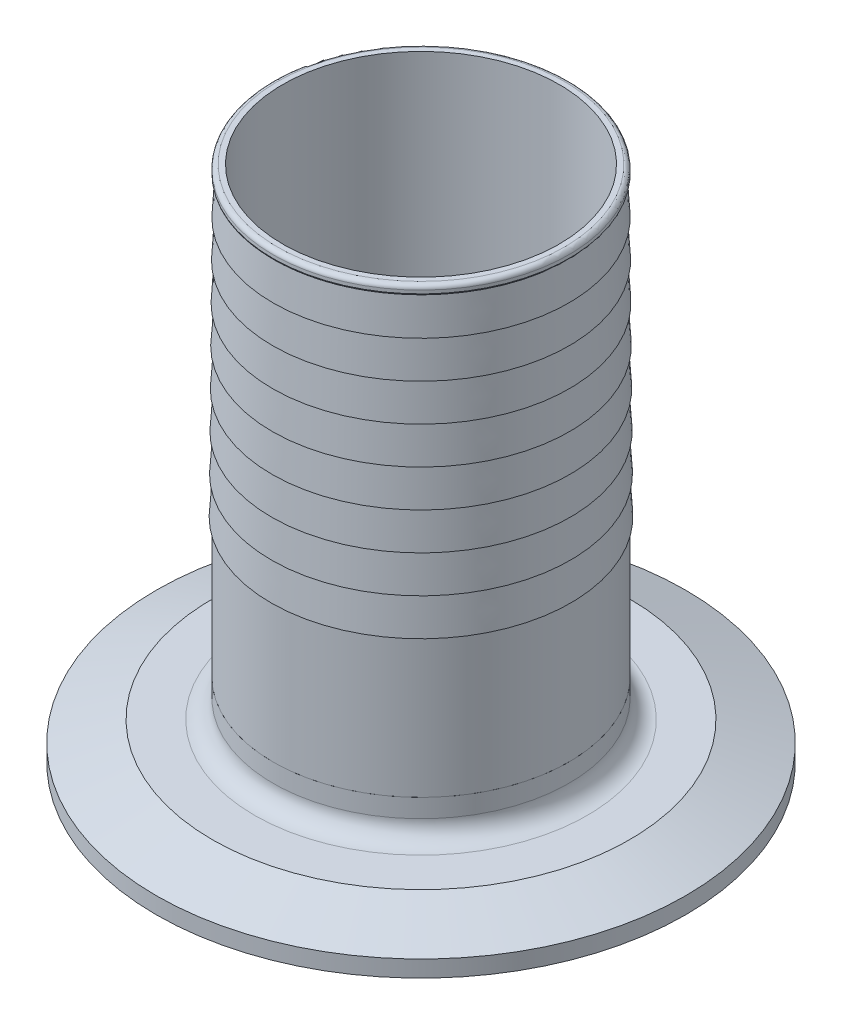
ISO-10303-21;
HEADER;
FILE_DESCRIPTION(('STEP AP214'),'2;1');
FILE_NAME('part.step','',(''),(''),'','','');
FILE_SCHEMA(('AUTOMOTIVE_DESIGN { 1 0 10303 214 1 1 1 1 }'));
ENDSEC;
DATA;
#1=APPLICATION_CONTEXT('core data for automotive mechanical design processes');
#2=APPLICATION_PROTOCOL_DEFINITION('international standard','automotive_design',2000,#1);
#3=PRODUCT_CONTEXT('',#1,'mechanical');
#4=PRODUCT('Part','Part','',(#3));
#5=PRODUCT_RELATED_PRODUCT_CATEGORY('part','',(#4));
#6=PRODUCT_DEFINITION_FORMATION('','',#4);
#7=PRODUCT_DEFINITION_CONTEXT('part definition',#1,'design');
#8=PRODUCT_DEFINITION('design','',#6,#7);
#9=PRODUCT_DEFINITION_SHAPE('','',#8);
#10=(LENGTH_UNIT() NAMED_UNIT(*) SI_UNIT(.MILLI.,.METRE.));
#11=(NAMED_UNIT(*) PLANE_ANGLE_UNIT() SI_UNIT($,.RADIAN.));
#12=(NAMED_UNIT(*) SI_UNIT($,.STERADIAN.) SOLID_ANGLE_UNIT());
#13=UNCERTAINTY_MEASURE_WITH_UNIT(LENGTH_MEASURE(1.E-05),#10,'distance_accuracy_value','');
#14=(GEOMETRIC_REPRESENTATION_CONTEXT(3) GLOBAL_UNCERTAINTY_ASSIGNED_CONTEXT((#13)) GLOBAL_UNIT_ASSIGNED_CONTEXT((#10,
#11,#12)) REPRESENTATION_CONTEXT('',''));
#15=CARTESIAN_POINT('',(0.,0.,0.));
#16=DIRECTION('',(0.,0.,1.));
#17=DIRECTION('',(1.,0.,0.));
#18=AXIS2_PLACEMENT_3D('',#15,#16,#17);
#19=CARTESIAN_POINT('',(69.3578354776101,55.2063556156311,71.2690609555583));
#20=DIRECTION('',(0.,-1.,0.));
#21=DIRECTION('',(0.140194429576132,0.,-0.990123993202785));
#22=AXIS2_PLACEMENT_3D('',#19,#20,#21);
#23=PLANE('',#22);
#24=CARTESIAN_POINT('',(44.2086860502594,55.2063556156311,67.7081224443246));
#25=DIRECTION('',(0.,-1.,0.));
#26=DIRECTION('',(0.140194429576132,0.,-0.990123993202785));
#27=AXIS2_PLACEMENT_3D('',#24,#25,#26);
#28=CIRCLE('',#27,23.749);
#29=CARTESIAN_POINT('',(47.5381635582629,55.2063556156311,44.1936677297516));
#30=VERTEX_POINT('',#29);
#31=EDGE_CURVE('P0_E88',#30,#30,#28,.T.);
#32=ORIENTED_EDGE('',*,*,#31,.F.);
#33=EDGE_LOOP('',(#32));
#34=FACE_BOUND('',#33,.T.);
#35=CARTESIAN_POINT('',(44.2086860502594,55.2063556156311,67.7081224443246));
#36=DIRECTION('',(0.,-1.,0.));
#37=DIRECTION('',(0.140194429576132,0.,-0.990123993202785));
#38=AXIS2_PLACEMENT_3D('',#35,#36,#37);
#39=CIRCLE('',#38,25.4);
#40=CARTESIAN_POINT('',(47.7696245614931,55.2063556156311,42.5589730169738));
#41=VERTEX_POINT('',#40);
#42=EDGE_CURVE('P0_E9',#41,#41,#39,.T.);
#43=ORIENTED_EDGE('',*,*,#42,.T.);
#44=EDGE_LOOP('',(#43));
#45=FACE_BOUND('',#44,.T.);
#46=ADVANCED_FACE('P0_F14',(#34,#45),#23,.T.);
#47=CARTESIAN_POINT('',(44.2086860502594,55.2063556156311,67.7081224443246));
#48=DIRECTION('',(0.,-1.,0.));
#49=DIRECTION('',(0.140194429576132,0.,-0.990123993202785));
#50=AXIS2_PLACEMENT_3D('',#47,#48,#49);
#51=CYLINDRICAL_SURFACE('',#50,25.4);
#52=CARTESIAN_POINT('',(44.2086860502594,79.0300392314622,67.7081224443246));
#53=DIRECTION('',(0.,-1.,0.));
#54=DIRECTION('',(0.140194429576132,0.,-0.990123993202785));
#55=AXIS2_PLACEMENT_3D('',#52,#53,#54);
#56=CIRCLE('',#55,25.4);
#57=CARTESIAN_POINT('',(47.7696245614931,79.0300392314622,42.5589730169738));
#58=VERTEX_POINT('',#57);
#59=EDGE_CURVE('P0_E20',#58,#58,#56,.T.);
#60=ORIENTED_EDGE('',*,*,#59,.T.);
#61=EDGE_LOOP('',(#60));
#62=FACE_BOUND('',#61,.T.);
#63=ORIENTED_EDGE('',*,*,#42,.F.);
#64=EDGE_LOOP('',(#63));
#65=FACE_BOUND('',#64,.T.);
#66=ADVANCED_FACE('P0_F104',(#62,#65),#51,.T.);
#67=CARTESIAN_POINT('',(69.687918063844,79.0300365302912,71.3157982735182));
#68=DIRECTION('',(0.,-1.,0.));
#69=DIRECTION('',(0.140194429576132,0.,-0.990123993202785));
#70=AXIS2_PLACEMENT_3D('',#67,#68,#69);
#71=PLANE('',#70);
#72=CARTESIAN_POINT('',(44.2086860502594,79.0300338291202,67.7081224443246));
#73=DIRECTION('',(0.,-1.,0.));
#74=DIRECTION('',(0.140194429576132,0.,-0.990123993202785));
#75=AXIS2_PLACEMENT_3D('',#72,#73,#74);
#76=CIRCLE('',#75,25.733375);
#77=CARTESIAN_POINT('',(47.8163618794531,79.0300338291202,42.2288904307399));
#78=VERTEX_POINT('',#77);
#79=EDGE_CURVE('P0_E24',#78,#78,#76,.T.);
#80=ORIENTED_EDGE('',*,*,#79,.T.);
#81=EDGE_LOOP('',(#80));
#82=FACE_BOUND('',#81,.T.);
#83=ORIENTED_EDGE('',*,*,#59,.F.);
#84=EDGE_LOOP('',(#83));
#85=FACE_BOUND('',#84,.T.);
#86=ADVANCED_FACE('P0_F109',(#82,#85),#71,.T.);
#87=CARTESIAN_POINT('',(44.2086860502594,79.0300338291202,67.7081224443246));
#88=DIRECTION('',(0.,-1.,0.));
#89=DIRECTION('',(0.140194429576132,0.,-0.990123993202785));
#90=AXIS2_PLACEMENT_3D('',#87,#88,#89);
#91=CONICAL_SURFACE('',#90,25.733375,0.0599260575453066);
#92=CARTESIAN_POINT('',(44.2086860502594,85.3802566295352,67.7081224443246));
#93=DIRECTION('',(0.,-1.,0.));
#94=DIRECTION('',(0.140194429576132,0.,-0.990123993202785));
#95=AXIS2_PLACEMENT_3D('',#92,#93,#94);
#96=CIRCLE('',#95,25.352375);
#97=CARTESIAN_POINT('',(47.7629478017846,85.3802566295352,42.6061276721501));
#98=VERTEX_POINT('',#97);
#99=EDGE_CURVE('P0_E28',#98,#98,#96,.T.);
#100=ORIENTED_EDGE('',*,*,#99,.T.);
#101=EDGE_LOOP('',(#100));
#102=FACE_BOUND('',#101,.T.);
#103=ORIENTED_EDGE('',*,*,#79,.F.);
#104=EDGE_LOOP('',(#103));
#105=FACE_BOUND('',#104,.T.);
#106=ADVANCED_FACE('P0_F113',(#102,#105),#91,.T.);
#107=CARTESIAN_POINT('',(69.6407634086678,85.3802539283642,71.3091215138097));
#108=DIRECTION('',(0.,-1.,0.));
#109=DIRECTION('',(0.140194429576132,0.,-0.990123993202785));
#110=AXIS2_PLACEMENT_3D('',#107,#108,#109);
#111=PLANE('',#110);
#112=CARTESIAN_POINT('',(44.2086860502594,85.3802512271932,67.7081224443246));
#113=DIRECTION('',(0.,-1.,0.));
#114=DIRECTION('',(0.140194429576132,0.,-0.990123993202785));
#115=AXIS2_PLACEMENT_3D('',#112,#113,#114);
#116=CIRCLE('',#115,25.68575);
#117=CARTESIAN_POINT('',(47.8096851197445,85.3802512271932,42.2760450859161));
#118=VERTEX_POINT('',#117);
#119=EDGE_CURVE('P0_E33',#118,#118,#116,.T.);
#120=ORIENTED_EDGE('',*,*,#119,.T.);
#121=EDGE_LOOP('',(#120));
#122=FACE_BOUND('',#121,.T.);
#123=ORIENTED_EDGE('',*,*,#99,.F.);
#124=EDGE_LOOP('',(#123));
#125=FACE_BOUND('',#124,.T.);
#126=ADVANCED_FACE('P0_F120',(#122,#125),#111,.T.);
#127=CARTESIAN_POINT('',(44.2086860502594,85.3802512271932,67.7081224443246));
#128=DIRECTION('',(0.,-1.,0.));
#129=DIRECTION('',(0.140194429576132,0.,-0.990123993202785));
#130=AXIS2_PLACEMENT_3D('',#127,#128,#129);
#131=CONICAL_SURFACE('',#130,25.68575,0.0599260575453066);
#132=CARTESIAN_POINT('',(44.2086860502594,91.7304740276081,67.7081224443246));
#133=DIRECTION('',(0.,-1.,0.));
#134=DIRECTION('',(0.140194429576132,0.,-0.990123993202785));
#135=AXIS2_PLACEMENT_3D('',#132,#133,#134);
#136=CIRCLE('',#135,25.30475);
#137=CARTESIAN_POINT('',(47.756271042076,91.7304740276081,42.6532823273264));
#138=VERTEX_POINT('',#137);
#139=EDGE_CURVE('P0_E36',#138,#138,#136,.T.);
#140=ORIENTED_EDGE('',*,*,#139,.T.);
#141=EDGE_LOOP('',(#140));
#142=FACE_BOUND('',#141,.T.);
#143=ORIENTED_EDGE('',*,*,#119,.F.);
#144=EDGE_LOOP('',(#143));
#145=FACE_BOUND('',#144,.T.);
#146=ADVANCED_FACE('P0_F124',(#142,#145),#131,.T.);
#147=CARTESIAN_POINT('',(69.5936087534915,91.7304713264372,71.3024447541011));
#148=DIRECTION('',(0.,-1.,0.));
#149=DIRECTION('',(0.140194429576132,0.,-0.990123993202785));
#150=AXIS2_PLACEMENT_3D('',#147,#148,#149);
#151=PLANE('',#150);
#152=CARTESIAN_POINT('',(44.2086860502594,91.7304686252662,67.7081224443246));
#153=DIRECTION('',(0.,-1.,0.));
#154=DIRECTION('',(0.140194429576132,0.,-0.990123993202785));
#155=AXIS2_PLACEMENT_3D('',#152,#153,#154);
#156=CIRCLE('',#155,25.638125);
#157=CARTESIAN_POINT('',(47.8030083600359,91.7304686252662,42.3231997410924));
#158=VERTEX_POINT('',#157);
#159=EDGE_CURVE('P0_E39',#158,#158,#156,.T.);
#160=ORIENTED_EDGE('',*,*,#159,.T.);
#161=EDGE_LOOP('',(#160));
#162=FACE_BOUND('',#161,.T.);
#163=ORIENTED_EDGE('',*,*,#139,.F.);
#164=EDGE_LOOP('',(#163));
#165=FACE_BOUND('',#164,.T.);
#166=ADVANCED_FACE('P0_F128',(#162,#165),#151,.T.);
#167=CARTESIAN_POINT('',(44.2086860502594,91.7304686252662,67.7081224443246));
#168=DIRECTION('',(0.,-1.,0.));
#169=DIRECTION('',(0.140194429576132,0.,-0.990123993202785));
#170=AXIS2_PLACEMENT_3D('',#167,#168,#169);
#171=CONICAL_SURFACE('',#170,25.638125,0.0599260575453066);
#172=CARTESIAN_POINT('',(44.2086860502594,98.0806914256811,67.7081224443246));
#173=DIRECTION('',(0.,-1.,0.));
#174=DIRECTION('',(0.140194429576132,0.,-0.990123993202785));
#175=AXIS2_PLACEMENT_3D('',#172,#173,#174);
#176=CIRCLE('',#175,25.257125);
#177=CARTESIAN_POINT('',(47.7495942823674,98.0806914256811,42.7004369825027));
#178=VERTEX_POINT('',#177);
#179=EDGE_CURVE('P0_E42',#178,#178,#176,.T.);
#180=ORIENTED_EDGE('',*,*,#179,.T.);
#181=EDGE_LOOP('',(#180));
#182=FACE_BOUND('',#181,.T.);
#183=ORIENTED_EDGE('',*,*,#159,.F.);
#184=EDGE_LOOP('',(#183));
#185=FACE_BOUND('',#184,.T.);
#186=ADVANCED_FACE('P0_F132',(#182,#185),#171,.T.);
#187=CARTESIAN_POINT('',(69.5464540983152,98.0806887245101,71.2957679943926));
#188=DIRECTION('',(0.,-1.,0.));
#189=DIRECTION('',(0.140194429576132,0.,-0.990123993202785));
#190=AXIS2_PLACEMENT_3D('',#187,#188,#189);
#191=PLANE('',#190);
#192=CARTESIAN_POINT('',(44.2086860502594,98.0806860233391,67.7081224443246));
#193=DIRECTION('',(0.,-1.,0.));
#194=DIRECTION('',(0.140194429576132,0.,-0.990123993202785));
#195=AXIS2_PLACEMENT_3D('',#192,#193,#194);
#196=CIRCLE('',#195,25.5905);
#197=CARTESIAN_POINT('',(47.7963316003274,98.0806860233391,42.3703543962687));
#198=VERTEX_POINT('',#197);
#199=EDGE_CURVE('P0_E45',#198,#198,#196,.T.);
#200=ORIENTED_EDGE('',*,*,#199,.T.);
#201=EDGE_LOOP('',(#200));
#202=FACE_BOUND('',#201,.T.);
#203=ORIENTED_EDGE('',*,*,#179,.F.);
#204=EDGE_LOOP('',(#203));
#205=FACE_BOUND('',#204,.T.);
#206=ADVANCED_FACE('P0_F136',(#202,#205),#191,.T.);
#207=CARTESIAN_POINT('',(44.2086860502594,98.0806860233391,67.7081224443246));
#208=DIRECTION('',(0.,-1.,0.));
#209=DIRECTION('',(0.140194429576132,0.,-0.990123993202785));
#210=AXIS2_PLACEMENT_3D('',#207,#208,#209);
#211=CONICAL_SURFACE('',#210,25.5905,0.0599260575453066);
#212=CARTESIAN_POINT('',(44.2086860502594,104.430908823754,67.7081224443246));
#213=DIRECTION('',(0.,-1.,0.));
#214=DIRECTION('',(0.140194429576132,0.,-0.990123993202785));
#215=AXIS2_PLACEMENT_3D('',#212,#213,#214);
#216=CIRCLE('',#215,25.2095);
#217=CARTESIAN_POINT('',(47.7429175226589,104.430908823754,42.747591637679));
#218=VERTEX_POINT('',#217);
#219=EDGE_CURVE('P0_E48',#218,#218,#216,.T.);
#220=ORIENTED_EDGE('',*,*,#219,.T.);
#221=EDGE_LOOP('',(#220));
#222=FACE_BOUND('',#221,.T.);
#223=ORIENTED_EDGE('',*,*,#199,.F.);
#224=EDGE_LOOP('',(#223));
#225=FACE_BOUND('',#224,.T.);
#226=ADVANCED_FACE('P0_F140',(#222,#225),#211,.T.);
#227=CARTESIAN_POINT('',(69.4992994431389,104.430906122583,71.2890912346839));
#228=DIRECTION('',(0.,-1.,0.));
#229=DIRECTION('',(0.140194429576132,0.,-0.990123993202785));
#230=AXIS2_PLACEMENT_3D('',#227,#228,#229);
#231=PLANE('',#230);
#232=CARTESIAN_POINT('',(44.2086860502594,104.430903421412,67.7081224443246));
#233=DIRECTION('',(0.,-1.,0.));
#234=DIRECTION('',(0.140194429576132,0.,-0.990123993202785));
#235=AXIS2_PLACEMENT_3D('',#232,#233,#234);
#236=CIRCLE('',#235,25.542875);
#237=CARTESIAN_POINT('',(47.7896548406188,104.430903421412,42.417509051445));
#238=VERTEX_POINT('',#237);
#239=EDGE_CURVE('P0_E51',#238,#238,#236,.T.);
#240=ORIENTED_EDGE('',*,*,#239,.T.);
#241=EDGE_LOOP('',(#240));
#242=FACE_BOUND('',#241,.T.);
#243=ORIENTED_EDGE('',*,*,#219,.F.);
#244=EDGE_LOOP('',(#243));
#245=FACE_BOUND('',#244,.T.);
#246=ADVANCED_FACE('P0_F144',(#242,#245),#231,.T.);
#247=CARTESIAN_POINT('',(44.2086860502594,104.430903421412,67.7081224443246));
#248=DIRECTION('',(0.,-1.,0.));
#249=DIRECTION('',(0.140194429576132,0.,-0.990123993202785));
#250=AXIS2_PLACEMENT_3D('',#247,#248,#249);
#251=CONICAL_SURFACE('',#250,25.542875,0.0599260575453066);
#252=CARTESIAN_POINT('',(44.2086860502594,110.781126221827,67.7081224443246));
#253=DIRECTION('',(0.,-1.,0.));
#254=DIRECTION('',(0.140194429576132,0.,-0.990123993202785));
#255=AXIS2_PLACEMENT_3D('',#252,#253,#254);
#256=CIRCLE('',#255,25.161875);
#257=CARTESIAN_POINT('',(47.7362407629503,110.781126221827,42.7947462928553));
#258=VERTEX_POINT('',#257);
#259=EDGE_CURVE('P0_E54',#258,#258,#256,.T.);
#260=ORIENTED_EDGE('',*,*,#259,.T.);
#261=EDGE_LOOP('',(#260));
#262=FACE_BOUND('',#261,.T.);
#263=ORIENTED_EDGE('',*,*,#239,.F.);
#264=EDGE_LOOP('',(#263));
#265=FACE_BOUND('',#264,.T.);
#266=ADVANCED_FACE('P0_F148',(#262,#265),#251,.T.);
#267=CARTESIAN_POINT('',(69.4521447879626,110.781123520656,71.2824144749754));
#268=DIRECTION('',(0.,-1.,0.));
#269=DIRECTION('',(0.140194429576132,0.,-0.990123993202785));
#270=AXIS2_PLACEMENT_3D('',#267,#268,#269);
#271=PLANE('',#270);
#272=CARTESIAN_POINT('',(44.2086860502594,110.781120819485,67.7081224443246));
#273=DIRECTION('',(0.,-1.,0.));
#274=DIRECTION('',(0.140194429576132,0.,-0.990123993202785));
#275=AXIS2_PLACEMENT_3D('',#272,#273,#274);
#276=CIRCLE('',#275,25.49525);
#277=CARTESIAN_POINT('',(47.7829780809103,110.781120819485,42.4646637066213));
#278=VERTEX_POINT('',#277);
#279=EDGE_CURVE('P0_E57',#278,#278,#276,.T.);
#280=ORIENTED_EDGE('',*,*,#279,.T.);
#281=EDGE_LOOP('',(#280));
#282=FACE_BOUND('',#281,.T.);
#283=ORIENTED_EDGE('',*,*,#259,.F.);
#284=EDGE_LOOP('',(#283));
#285=FACE_BOUND('',#284,.T.);
#286=ADVANCED_FACE('P0_F152',(#282,#285),#271,.T.);
#287=CARTESIAN_POINT('',(44.2086860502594,110.781120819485,67.7081224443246));
#288=DIRECTION('',(0.,-1.,0.));
#289=DIRECTION('',(0.140194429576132,0.,-0.990123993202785));
#290=AXIS2_PLACEMENT_3D('',#287,#288,#289);
#291=CONICAL_SURFACE('',#290,25.49525,0.0599260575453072);
#292=CARTESIAN_POINT('',(44.2086860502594,117.1313436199,67.7081224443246));
#293=DIRECTION('',(0.,-1.,0.));
#294=DIRECTION('',(0.140194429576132,0.,-0.990123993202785));
#295=AXIS2_PLACEMENT_3D('',#292,#293,#294);
#296=CIRCLE('',#295,25.11425);
#297=CARTESIAN_POINT('',(47.7295640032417,117.1313436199,42.8419009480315));
#298=VERTEX_POINT('',#297);
#299=EDGE_CURVE('P0_E60',#298,#298,#296,.T.);
#300=ORIENTED_EDGE('',*,*,#299,.T.);
#301=EDGE_LOOP('',(#300));
#302=FACE_BOUND('',#301,.T.);
#303=ORIENTED_EDGE('',*,*,#279,.F.);
#304=EDGE_LOOP('',(#303));
#305=FACE_BOUND('',#304,.T.);
#306=ADVANCED_FACE('P0_F156',(#302,#305),#291,.T.);
#307=CARTESIAN_POINT('',(69.4049901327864,117.131340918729,71.2757377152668));
#308=DIRECTION('',(0.,-1.,0.));
#309=DIRECTION('',(0.140194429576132,0.,-0.990123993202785));
#310=AXIS2_PLACEMENT_3D('',#307,#308,#309);
#311=PLANE('',#310);
#312=CARTESIAN_POINT('',(44.2086860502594,117.131338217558,67.7081224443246));
#313=DIRECTION('',(0.,-1.,0.));
#314=DIRECTION('',(0.140194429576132,0.,-0.990123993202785));
#315=AXIS2_PLACEMENT_3D('',#312,#313,#314);
#316=CIRCLE('',#315,25.447625);
#317=CARTESIAN_POINT('',(47.7763013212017,117.131338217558,42.5118183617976));
#318=VERTEX_POINT('',#317);
#319=EDGE_CURVE('P0_E63',#318,#318,#316,.T.);
#320=ORIENTED_EDGE('',*,*,#319,.T.);
#321=EDGE_LOOP('',(#320));
#322=FACE_BOUND('',#321,.T.);
#323=ORIENTED_EDGE('',*,*,#299,.F.);
#324=EDGE_LOOP('',(#323));
#325=FACE_BOUND('',#324,.T.);
#326=ADVANCED_FACE('P0_F160',(#322,#325),#311,.T.);
#327=CARTESIAN_POINT('',(44.2086860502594,117.131338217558,67.7081224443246));
#328=DIRECTION('',(0.,-1.,0.));
#329=DIRECTION('',(0.140194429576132,0.,-0.990123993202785));
#330=AXIS2_PLACEMENT_3D('',#327,#328,#329);
#331=CONICAL_SURFACE('',#330,25.447625,0.0599260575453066);
#332=CARTESIAN_POINT('',(44.2086860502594,123.481561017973,67.7081224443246));
#333=DIRECTION('',(0.,-1.,0.));
#334=DIRECTION('',(0.140194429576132,0.,-0.990123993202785));
#335=AXIS2_PLACEMENT_3D('',#332,#333,#334);
#336=CIRCLE('',#335,25.066625);
#337=CARTESIAN_POINT('',(47.7228872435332,123.481561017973,42.8890556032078));
#338=VERTEX_POINT('',#337);
#339=EDGE_CURVE('P0_E66',#338,#338,#336,.T.);
#340=ORIENTED_EDGE('',*,*,#339,.T.);
#341=EDGE_LOOP('',(#340));
#342=FACE_BOUND('',#341,.T.);
#343=ORIENTED_EDGE('',*,*,#319,.F.);
#344=EDGE_LOOP('',(#343));
#345=FACE_BOUND('',#344,.T.);
#346=ADVANCED_FACE('P0_F164',(#342,#345),#331,.T.);
#347=CARTESIAN_POINT('',(69.35783547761,123.481558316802,71.2690609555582));
#348=DIRECTION('',(0.,-1.,0.));
#349=DIRECTION('',(0.140194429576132,0.,-0.990123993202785));
#350=AXIS2_PLACEMENT_3D('',#347,#348,#349);
#351=PLANE('',#350);
#352=CARTESIAN_POINT('',(44.2086860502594,123.481555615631,67.7081224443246));
#353=DIRECTION('',(0.,-1.,0.));
#354=DIRECTION('',(0.140194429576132,0.,-0.990123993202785));
#355=AXIS2_PLACEMENT_3D('',#352,#353,#354);
#356=CIRCLE('',#355,25.4);
#357=CARTESIAN_POINT('',(47.7696245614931,123.481555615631,42.5589730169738));
#358=VERTEX_POINT('',#357);
#359=EDGE_CURVE('P0_E69',#358,#358,#356,.T.);
#360=ORIENTED_EDGE('',*,*,#359,.T.);
#361=EDGE_LOOP('',(#360));
#362=FACE_BOUND('',#361,.T.);
#363=ORIENTED_EDGE('',*,*,#339,.F.);
#364=EDGE_LOOP('',(#363));
#365=FACE_BOUND('',#364,.T.);
#366=ADVANCED_FACE('P0_F168',(#362,#365),#351,.T.);
#367=CARTESIAN_POINT('',(44.2086860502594,123.481555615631,67.7081224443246));
#368=DIRECTION('',(0.,-1.,0.));
#369=DIRECTION('',(0.140194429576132,0.,-0.990123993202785));
#370=AXIS2_PLACEMENT_3D('',#367,#368,#369);
#371=CONICAL_SURFACE('',#370,25.4,0.0599260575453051);
#372=CARTESIAN_POINT('',(44.2086860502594,129.831778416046,67.7081224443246));
#373=DIRECTION('',(0.,-1.,0.));
#374=DIRECTION('',(0.140194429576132,0.,-0.990123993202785));
#375=AXIS2_PLACEMENT_3D('',#372,#373,#374);
#376=CIRCLE('',#375,25.019);
#377=CARTESIAN_POINT('',(47.7162104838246,129.831778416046,42.9362102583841));
#378=VERTEX_POINT('',#377);
#379=EDGE_CURVE('P0_E72',#378,#378,#376,.T.);
#380=ORIENTED_EDGE('',*,*,#379,.T.);
#381=EDGE_LOOP('',(#380));
#382=FACE_BOUND('',#381,.T.);
#383=ORIENTED_EDGE('',*,*,#359,.F.);
#384=EDGE_LOOP('',(#383));
#385=FACE_BOUND('',#384,.T.);
#386=ADVANCED_FACE('P0_F172',(#382,#385),#371,.T.);
#387=CARTESIAN_POINT('',(44.2086860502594,129.831778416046,67.7081224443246));
#388=DIRECTION('',(0.,-1.,0.));
#389=DIRECTION('',(0.140194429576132,0.,-0.990123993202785));
#390=AXIS2_PLACEMENT_3D('',#387,#388,#389);
#391=CONICAL_SURFACE('',#390,25.019,1.57021154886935);
#392=CARTESIAN_POINT('',(44.2086860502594,129.8317042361,67.7081224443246));
#393=DIRECTION('',(0.,-1.,0.));
#394=DIRECTION('',(0.140194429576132,0.,-0.990123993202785));
#395=AXIS2_PLACEMENT_3D('',#392,#393,#394);
#396=CIRCLE('',#395,25.1458514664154);
#397=CARTESIAN_POINT('',(47.7339943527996,129.8317042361,42.8106115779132));
#398=VERTEX_POINT('',#397);
#399=EDGE_CURVE('P0_E75',#398,#398,#396,.T.);
#400=ORIENTED_EDGE('',*,*,#399,.T.);
#401=EDGE_LOOP('',(#400));
#402=FACE_BOUND('',#401,.T.);
#403=ORIENTED_EDGE('',*,*,#379,.F.);
#404=EDGE_LOOP('',(#403));
#405=FACE_BOUND('',#404,.T.);
#406=ADVANCED_FACE('P0_F176',(#402,#405),#391,.F.);
#407=CARTESIAN_POINT('',(44.2086860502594,130.085704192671,67.7081224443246));
#408=DIRECTION('',(0.,-1.,0.));
#409=DIRECTION('',(0.140194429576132,0.,-0.990123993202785));
#410=AXIS2_PLACEMENT_3D('',#407,#408,#409);
#411=TOROIDAL_SURFACE('',#410,25.146,0.254000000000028);
#412=CARTESIAN_POINT('',(44.2086860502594,130.085704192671,67.7081224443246));
#413=DIRECTION('',(0.,-1.,0.));
#414=DIRECTION('',(0.140194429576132,0.,-0.990123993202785));
#415=AXIS2_PLACEMENT_3D('',#412,#413,#414);
#416=CIRCLE('',#415,25.4);
#417=CARTESIAN_POINT('',(47.7696245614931,130.085704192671,42.5589730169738));
#418=VERTEX_POINT('',#417);
#419=EDGE_CURVE('P0_E78',#418,#418,#416,.T.);
#420=ORIENTED_EDGE('',*,*,#419,.T.);
#421=EDGE_LOOP('',(#420));
#422=FACE_BOUND('',#421,.T.);
#423=ORIENTED_EDGE('',*,*,#399,.F.);
#424=EDGE_LOOP('',(#423));
#425=FACE_BOUND('',#424,.T.);
#426=ADVANCED_FACE('P0_F180',(#422,#425),#411,.T.);
#427=CARTESIAN_POINT('',(44.2086860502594,55.2063556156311,67.7081224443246));
#428=DIRECTION('',(0.,-1.,0.));
#429=DIRECTION('',(0.140194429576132,0.,-0.990123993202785));
#430=AXIS2_PLACEMENT_3D('',#427,#428,#429);
#431=CYLINDRICAL_SURFACE('',#430,25.4);
#432=CARTESIAN_POINT('',(44.2086860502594,130.644355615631,67.7081224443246));
#433=DIRECTION('',(0.,-1.,0.));
#434=DIRECTION('',(0.140194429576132,0.,-0.990123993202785));
#435=AXIS2_PLACEMENT_3D('',#432,#433,#434);
#436=CIRCLE('',#435,25.4);
#437=CARTESIAN_POINT('',(47.7696245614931,130.644355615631,42.5589730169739));
#438=VERTEX_POINT('',#437);
#439=EDGE_CURVE('P0_E81',#438,#438,#436,.T.);
#440=ORIENTED_EDGE('',*,*,#439,.T.);
#441=EDGE_LOOP('',(#440));
#442=FACE_BOUND('',#441,.T.);
#443=ORIENTED_EDGE('',*,*,#419,.F.);
#444=EDGE_LOOP('',(#443));
#445=FACE_BOUND('',#444,.T.);
#446=ADVANCED_FACE('P0_F184',(#442,#445),#431,.T.);
#447=CARTESIAN_POINT('',(44.2086860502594,130.644355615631,67.7081224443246));
#448=DIRECTION('',(0.,-1.,0.));
#449=DIRECTION('',(0.140194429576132,0.,-0.990123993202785));
#450=AXIS2_PLACEMENT_3D('',#447,#448,#449);
#451=TOROIDAL_SURFACE('',#450,24.638,0.761999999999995);
#452=CARTESIAN_POINT('',(44.2086860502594,131.406355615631,67.7081224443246));
#453=DIRECTION('',(0.,-1.,0.));
#454=DIRECTION('',(0.140194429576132,0.,-0.990123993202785));
#455=AXIS2_PLACEMENT_3D('',#452,#453,#454);
#456=CIRCLE('',#455,24.638);
#457=CARTESIAN_POINT('',(47.6627964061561,131.406355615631,43.3134474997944));
#458=VERTEX_POINT('',#457);
#459=EDGE_CURVE('P0_E84',#458,#458,#456,.T.);
#460=ORIENTED_EDGE('',*,*,#459,.T.);
#461=EDGE_LOOP('',(#460));
#462=FACE_BOUND('',#461,.T.);
#463=ORIENTED_EDGE('',*,*,#439,.F.);
#464=EDGE_LOOP('',(#463));
#465=FACE_BOUND('',#464,.T.);
#466=ADVANCED_FACE('P0_F188',(#462,#465),#451,.T.);
#467=CARTESIAN_POINT('',(44.2086860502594,131.406355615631,67.7081224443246));
#468=DIRECTION('',(0.,1.,0.));
#469=DIRECTION('',(-0.140194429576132,0.,0.990123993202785));
#470=AXIS2_PLACEMENT_3D('',#467,#468,#469);
#471=PLANE('',#470);
#472=CARTESIAN_POINT('',(44.2086860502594,131.406355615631,67.7081224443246));
#473=DIRECTION('',(0.,-1.,0.));
#474=DIRECTION('',(0.140194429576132,0.,-0.990123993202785));
#475=AXIS2_PLACEMENT_3D('',#472,#473,#474);
#476=CIRCLE('',#475,23.749);
#477=CARTESIAN_POINT('',(47.5381635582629,131.406355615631,44.1936677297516));
#478=VERTEX_POINT('',#477);
#479=EDGE_CURVE('P0_E87',#478,#478,#476,.T.);
#480=ORIENTED_EDGE('',*,*,#479,.T.);
#481=EDGE_LOOP('',(#480));
#482=FACE_BOUND('',#481,.T.);
#483=ORIENTED_EDGE('',*,*,#459,.F.);
#484=EDGE_LOOP('',(#483));
#485=FACE_BOUND('',#484,.T.);
#486=ADVANCED_FACE('P0_F94',(#482,#485),#471,.T.);
#487=CARTESIAN_POINT('',(44.2086860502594,131.406355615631,67.7081224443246));
#488=DIRECTION('',(0.,-1.,0.));
#489=DIRECTION('',(0.140194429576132,0.,-0.990123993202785));
#490=AXIS2_PLACEMENT_3D('',#487,#488,#489);
#491=CYLINDRICAL_SURFACE('',#490,23.749);
#492=CARTESIAN_POINT('',(47.5381635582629,131.406355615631,44.1936677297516));
#493=CARTESIAN_POINT('',(47.5381635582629,130.612605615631,44.1936677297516));
#494=CARTESIAN_POINT('',(47.5381635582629,129.818855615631,44.1936677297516));
#495=CARTESIAN_POINT('',(47.5381635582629,128.231355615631,44.1936677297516));
#496=CARTESIAN_POINT('',(47.5381635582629,127.437605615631,44.1936677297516));
#497=CARTESIAN_POINT('',(47.5381635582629,125.850105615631,44.1936677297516));
#498=CARTESIAN_POINT('',(47.5381635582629,125.056355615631,44.1936677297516));
#499=CARTESIAN_POINT('',(47.5381635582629,123.468855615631,44.1936677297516));
#500=CARTESIAN_POINT('',(47.5381635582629,122.675105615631,44.1936677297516));
#501=CARTESIAN_POINT('',(47.5381635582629,121.087605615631,44.1936677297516));
#502=CARTESIAN_POINT('',(47.5381635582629,120.293855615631,44.1936677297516));
#503=CARTESIAN_POINT('',(47.5381635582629,118.706355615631,44.1936677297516));
#504=CARTESIAN_POINT('',(47.5381635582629,117.912605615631,44.1936677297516));
#505=CARTESIAN_POINT('',(47.5381635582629,116.325105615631,44.1936677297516));
#506=CARTESIAN_POINT('',(47.5381635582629,115.531355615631,44.1936677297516));
#507=CARTESIAN_POINT('',(47.5381635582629,113.943855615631,44.1936677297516));
#508=CARTESIAN_POINT('',(47.5381635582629,113.150105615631,44.1936677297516));
#509=CARTESIAN_POINT('',(47.5381635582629,111.562605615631,44.1936677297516));
#510=CARTESIAN_POINT('',(47.5381635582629,110.768855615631,44.1936677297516));
#511=CARTESIAN_POINT('',(47.5381635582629,109.181355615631,44.1936677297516));
#512=CARTESIAN_POINT('',(47.5381635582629,108.387605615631,44.1936677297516));
#513=CARTESIAN_POINT('',(47.5381635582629,106.800105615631,44.1936677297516));
#514=CARTESIAN_POINT('',(47.5381635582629,106.006355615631,44.1936677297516));
#515=CARTESIAN_POINT('',(47.5381635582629,104.418855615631,44.1936677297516));
#516=CARTESIAN_POINT('',(47.5381635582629,103.625105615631,44.1936677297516));
#517=CARTESIAN_POINT('',(47.5381635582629,102.037605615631,44.1936677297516));
#518=CARTESIAN_POINT('',(47.5381635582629,101.243855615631,44.1936677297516));
#519=CARTESIAN_POINT('',(47.5381635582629,99.6563556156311,44.1936677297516));
#520=CARTESIAN_POINT('',(47.5381635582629,98.8626056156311,44.1936677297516));
#521=CARTESIAN_POINT('',(47.5381635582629,97.2751056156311,44.1936677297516));
#522=CARTESIAN_POINT('',(47.5381635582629,96.4813556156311,44.1936677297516));
#523=CARTESIAN_POINT('',(47.5381635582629,94.8938556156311,44.1936677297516));
#524=CARTESIAN_POINT('',(47.5381635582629,94.1001056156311,44.1936677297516));
#525=CARTESIAN_POINT('',(47.5381635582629,92.5126056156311,44.1936677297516));
#526=CARTESIAN_POINT('',(47.5381635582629,91.7188556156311,44.1936677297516));
#527=CARTESIAN_POINT('',(47.5381635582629,90.1313556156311,44.1936677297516));
#528=CARTESIAN_POINT('',(47.5381635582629,89.3376056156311,44.1936677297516));
#529=CARTESIAN_POINT('',(47.5381635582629,87.7501056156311,44.1936677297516));
#530=CARTESIAN_POINT('',(47.5381635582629,86.9563556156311,44.1936677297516));
#531=CARTESIAN_POINT('',(47.5381635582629,85.3688556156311,44.1936677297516));
#532=CARTESIAN_POINT('',(47.5381635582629,84.5751056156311,44.1936677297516));
#533=CARTESIAN_POINT('',(47.5381635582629,82.9876056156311,44.1936677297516));
#534=CARTESIAN_POINT('',(47.5381635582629,82.1938556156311,44.1936677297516));
#535=CARTESIAN_POINT('',(47.5381635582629,80.6063556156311,44.1936677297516));
#536=CARTESIAN_POINT('',(47.5381635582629,79.8126056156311,44.1936677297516));
#537=CARTESIAN_POINT('',(47.5381635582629,78.2251056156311,44.1936677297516));
#538=CARTESIAN_POINT('',(47.5381635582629,77.4313556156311,44.1936677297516));
#539=CARTESIAN_POINT('',(47.5381635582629,75.8438556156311,44.1936677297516));
#540=CARTESIAN_POINT('',(47.5381635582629,75.0501056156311,44.1936677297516));
#541=CARTESIAN_POINT('',(47.5381635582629,73.4626056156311,44.1936677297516));
#542=CARTESIAN_POINT('',(47.5381635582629,72.6688556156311,44.1936677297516));
#543=CARTESIAN_POINT('',(47.5381635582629,71.0813556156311,44.1936677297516));
#544=CARTESIAN_POINT('',(47.5381635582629,70.2876056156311,44.1936677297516));
#545=CARTESIAN_POINT('',(47.5381635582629,68.7001056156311,44.1936677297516));
#546=CARTESIAN_POINT('',(47.5381635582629,67.9063556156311,44.1936677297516));
#547=CARTESIAN_POINT('',(47.5381635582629,66.3188556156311,44.1936677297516));
#548=CARTESIAN_POINT('',(47.5381635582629,65.5251056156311,44.1936677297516));
#549=CARTESIAN_POINT('',(47.5381635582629,63.9376056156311,44.1936677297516));
#550=CARTESIAN_POINT('',(47.5381635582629,63.1438556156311,44.1936677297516));
#551=CARTESIAN_POINT('',(47.5381635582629,61.5563556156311,44.1936677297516));
#552=CARTESIAN_POINT('',(47.5381635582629,60.7626056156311,44.1936677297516));
#553=CARTESIAN_POINT('',(47.5381635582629,59.1751056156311,44.1936677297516));
#554=CARTESIAN_POINT('',(47.5381635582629,58.3813556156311,44.1936677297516));
#555=CARTESIAN_POINT('',(47.5381635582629,56.7938556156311,44.1936677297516));
#556=CARTESIAN_POINT('',(47.5381635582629,56.0001056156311,44.1936677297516));
#557=CARTESIAN_POINT('',(47.5381635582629,55.2063556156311,44.1936677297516));
#558=B_SPLINE_CURVE_WITH_KNOTS('',3,(#492,#493,#494,#495,#496,#497,#498,#499,#500,#501,#502,
#503,#504,#505,#506,#507,#508,#509,#510,#511,#512,#513,#514,#515,#516,#517,#518,#519,#520,#521,
#522,#523,#524,#525,#526,#527,#528,#529,#530,#531,#532,#533,#534,#535,#536,#537,#538,#539,#540,
#541,#542,#543,#544,#545,#546,#547,#548,#549,#550,#551,#552,#553,#554,#555,#556,#557),
.UNSPECIFIED.,.F.,.F.,(4,2,2,2,2,2,2,2,2,2,2,2,2,2,2,2,2,2,2,2,2,2,2,2,2,2,2,2,2,2,2,2,4),(0.,
2.38125000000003,4.76250000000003,7.14375000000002,9.52500000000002,11.90625,14.2875,16.66875,
19.05,21.43125,23.8125,26.19375,28.575,30.95625,33.3375,35.71875,38.1000000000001,
40.4812500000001,42.8625000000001,45.2437500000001,47.6250000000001,50.0062500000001,
52.3875000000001,54.7687500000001,57.1500000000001,59.5312500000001,61.9125000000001,
64.2937500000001,66.6750000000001,69.0562500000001,71.4375000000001,73.8187500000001,
76.2000000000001),.UNSPECIFIED.);
#559=EDGE_CURVE('P0_BSEAM97',#478,#30,#558,.T.);
#560=ORIENTED_EDGE('',*,*,#479,.F.);
#561=ORIENTED_EDGE('',*,*,#31,.T.);
#562=ORIENTED_EDGE('',*,*,#559,.T.);
#563=ORIENTED_EDGE('',*,*,#559,.F.);
#564=EDGE_LOOP('',(#560,#562,#561,#563));
#565=FACE_BOUND('',#564,.T.);
#566=ADVANCED_FACE('P0_F97',(#565),#491,.F.);
#567=CLOSED_SHELL('',(#46,#66,#86,#106,#126,#146,#166,#186,#206,#226,#246,#266,#286,#306,#326,
#346,#366,#386,#406,#426,#446,#466,#486,#566));
#568=MANIFOLD_SOLID_BREP('P0_B1',#567);
#569=CARTESIAN_POINT('',(20.4596860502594,55.2063556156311,67.7081224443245));
#570=DIRECTION('',(0.,-1.,0.));
#571=DIRECTION('',(0.,0.,-0.999999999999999));
#572=AXIS2_PLACEMENT_3D('',#569,#570,#571);
#573=PLANE('',#572);
#574=CARTESIAN_POINT('',(44.2086860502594,55.2063556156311,67.7081224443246));
#575=DIRECTION('',(0.,-1.,0.));
#576=DIRECTION('',(0.,0.,-0.999999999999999));
#577=AXIS2_PLACEMENT_3D('',#574,#575,#576);
#578=CIRCLE('',#577,25.4);
#579=CARTESIAN_POINT('',(44.2086860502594,55.2063556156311,42.3081224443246));
#580=VERTEX_POINT('',#579);
#581=EDGE_CURVE('P1_E10',#580,#580,#578,.T.);
#582=ORIENTED_EDGE('',*,*,#581,.F.);
#583=EDGE_LOOP('',(#582));
#584=FACE_BOUND('',#583,.T.);
#585=CARTESIAN_POINT('',(44.2086860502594,55.2063556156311,67.7081224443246));
#586=DIRECTION('',(0.,-1.,0.));
#587=DIRECTION('',(0.,0.,-0.999999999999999));
#588=AXIS2_PLACEMENT_3D('',#585,#586,#587);
#589=CIRCLE('',#588,23.749);
#590=CARTESIAN_POINT('',(44.2086860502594,55.2063556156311,43.9591224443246));
#591=VERTEX_POINT('',#590);
#592=EDGE_CURVE('P1_E64',#591,#591,#589,.T.);
#593=ORIENTED_EDGE('',*,*,#592,.T.);
#594=EDGE_LOOP('',(#593));
#595=FACE_BOUND('',#594,.T.);
#596=ADVANCED_FACE('P1_F15',(#584,#595),#573,.F.);
#597=CARTESIAN_POINT('',(44.2086860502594,42.5063556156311,67.7081224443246));
#598=DIRECTION('',(0.,-1.,0.));
#599=DIRECTION('',(0.,0.,-0.999999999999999));
#600=AXIS2_PLACEMENT_3D('',#597,#598,#599);
#601=CYLINDRICAL_SURFACE('',#600,25.4);
#602=CARTESIAN_POINT('',(44.2086860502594,52.0313556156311,67.7081224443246));
#603=DIRECTION('',(0.,-1.,0.));
#604=DIRECTION('',(0.,0.,-0.999999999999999));
#605=AXIS2_PLACEMENT_3D('',#602,#603,#604);
#606=CIRCLE('',#605,25.4);
#607=CARTESIAN_POINT('',(44.2086860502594,52.0313556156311,42.3081224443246));
#608=VERTEX_POINT('',#607);
#609=EDGE_CURVE('P1_E21',#608,#608,#606,.T.);
#610=ORIENTED_EDGE('',*,*,#609,.F.);
#611=EDGE_LOOP('',(#610));
#612=FACE_BOUND('',#611,.T.);
#613=ORIENTED_EDGE('',*,*,#581,.T.);
#614=EDGE_LOOP('',(#613));
#615=FACE_BOUND('',#614,.T.);
#616=ADVANCED_FACE('P1_F143',(#612,#615),#601,.T.);
#617=CARTESIAN_POINT('',(44.2086860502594,52.0313556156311,67.7081224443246));
#618=DIRECTION('',(0.,-1.,0.));
#619=DIRECTION('',(0.,0.,-0.999999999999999));
#620=AXIS2_PLACEMENT_3D('',#617,#618,#619);
#621=TOROIDAL_SURFACE('',#620,28.575,3.175);
#622=CARTESIAN_POINT('',(44.2086860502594,48.8563556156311,67.7081224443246));
#623=DIRECTION('',(0.,-1.,0.));
#624=DIRECTION('',(0.,0.,-0.999999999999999));
#625=AXIS2_PLACEMENT_3D('',#622,#623,#624);
#626=CIRCLE('',#625,28.575);
#627=CARTESIAN_POINT('',(44.2086860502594,48.8563556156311,39.1331224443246));
#628=VERTEX_POINT('',#627);
#629=EDGE_CURVE('P1_E25',#628,#628,#626,.T.);
#630=ORIENTED_EDGE('',*,*,#629,.F.);
#631=EDGE_LOOP('',(#630));
#632=FACE_BOUND('',#631,.T.);
#633=ORIENTED_EDGE('',*,*,#609,.T.);
#634=EDGE_LOOP('',(#633));
#635=FACE_BOUND('',#634,.T.);
#636=ADVANCED_FACE('P1_F138',(#632,#635),#621,.F.);
#637=CARTESIAN_POINT('',(15.6336860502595,48.8563556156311,67.7081224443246));
#638=DIRECTION('',(0.,-1.,0.));
#639=DIRECTION('',(0.,0.,-0.999999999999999));
#640=AXIS2_PLACEMENT_3D('',#637,#638,#639);
#641=PLANE('',#640);
#642=CARTESIAN_POINT('',(44.2086860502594,48.8563556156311,67.7081224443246));
#643=DIRECTION('',(0.,-1.,0.));
#644=DIRECTION('',(0.,0.,-0.999999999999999));
#645=AXIS2_PLACEMENT_3D('',#642,#643,#644);
#646=CIRCLE('',#645,35.8228421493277);
#647=CARTESIAN_POINT('',(44.2086860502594,48.8563556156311,31.8852802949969));
#648=VERTEX_POINT('',#647);
#649=EDGE_CURVE('P1_E29',#648,#648,#646,.T.);
#650=ORIENTED_EDGE('',*,*,#649,.F.);
#651=EDGE_LOOP('',(#650));
#652=FACE_BOUND('',#651,.T.);
#653=ORIENTED_EDGE('',*,*,#629,.T.);
#654=EDGE_LOOP('',(#653));
#655=FACE_BOUND('',#654,.T.);
#656=ADVANCED_FACE('P1_F132',(#652,#655),#641,.F.);
#657=CARTESIAN_POINT('',(44.2086860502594,48.8563556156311,67.7081224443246));
#658=DIRECTION('',(0.,-1.,0.));
#659=DIRECTION('',(0.,0.,-0.999999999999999));
#660=AXIS2_PLACEMENT_3D('',#657,#658,#659);
#661=CONICAL_SURFACE('',#660,35.8228421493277,1.22173047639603);
#662=CARTESIAN_POINT('',(44.2086860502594,45.3511556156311,67.7081224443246));
#663=DIRECTION('',(0.,-1.,0.));
#664=DIRECTION('',(0.,0.,-0.999999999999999));
#665=AXIS2_PLACEMENT_3D('',#662,#663,#664);
#666=CIRCLE('',#665,45.4533);
#667=CARTESIAN_POINT('',(44.2086860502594,45.3511556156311,22.2548224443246));
#668=VERTEX_POINT('',#667);
#669=EDGE_CURVE('P1_E34',#668,#668,#666,.T.);
#670=ORIENTED_EDGE('',*,*,#669,.F.);
#671=EDGE_LOOP('',(#670));
#672=FACE_BOUND('',#671,.T.);
#673=ORIENTED_EDGE('',*,*,#649,.T.);
#674=EDGE_LOOP('',(#673));
#675=FACE_BOUND('',#674,.T.);
#676=ADVANCED_FACE('P1_F126',(#672,#675),#661,.T.);
#677=CARTESIAN_POINT('',(44.2086860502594,42.5063556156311,67.7081224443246));
#678=DIRECTION('',(0.,-1.,0.));
#679=DIRECTION('',(0.,0.,-0.999999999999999));
#680=AXIS2_PLACEMENT_3D('',#677,#678,#679);
#681=CYLINDRICAL_SURFACE('',#680,45.4533);
#682=CARTESIAN_POINT('',(44.2086860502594,42.5063556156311,67.7081224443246));
#683=DIRECTION('',(0.,-1.,0.));
#684=DIRECTION('',(0.,0.,-0.999999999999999));
#685=AXIS2_PLACEMENT_3D('',#682,#683,#684);
#686=CIRCLE('',#685,45.4533);
#687=CARTESIAN_POINT('',(44.2086860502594,42.5063556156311,22.2548224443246));
#688=VERTEX_POINT('',#687);
#689=EDGE_CURVE('P1_E37',#688,#688,#686,.T.);
#690=ORIENTED_EDGE('',*,*,#689,.F.);
#691=EDGE_LOOP('',(#690));
#692=FACE_BOUND('',#691,.T.);
#693=ORIENTED_EDGE('',*,*,#669,.T.);
#694=EDGE_LOOP('',(#693));
#695=FACE_BOUND('',#694,.T.);
#696=ADVANCED_FACE('P1_F120',(#692,#695),#681,.T.);
#697=CARTESIAN_POINT('',(44.2086860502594,42.5063556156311,67.7081224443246));
#698=DIRECTION('',(0.,-1.,0.));
#699=DIRECTION('',(0.,0.,-0.999999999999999));
#700=AXIS2_PLACEMENT_3D('',#697,#698,#699);
#701=CONICAL_SURFACE('',#700,45.4533,1.56939586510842);
#702=CARTESIAN_POINT('',(44.2086860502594,42.5088680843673,67.7081224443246));
#703=DIRECTION('',(0.,-1.,0.));
#704=DIRECTION('',(0.,0.,-0.999999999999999));
#705=AXIS2_PLACEMENT_3D('',#702,#703,#704);
#706=CIRCLE('',#705,43.6592722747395);
#707=CARTESIAN_POINT('',(44.2086860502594,42.5088680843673,24.0488501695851));
#708=VERTEX_POINT('',#707);
#709=EDGE_CURVE('P1_E40',#708,#708,#706,.T.);
#710=ORIENTED_EDGE('',*,*,#709,.F.);
#711=EDGE_LOOP('',(#710));
#712=FACE_BOUND('',#711,.T.);
#713=ORIENTED_EDGE('',*,*,#689,.T.);
#714=EDGE_LOOP('',(#713));
#715=FACE_BOUND('',#714,.T.);
#716=ADVANCED_FACE('P1_F114',(#712,#715),#701,.F.);
#717=CARTESIAN_POINT('',(44.2086860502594,43.2962680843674,67.7081224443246));
#718=DIRECTION('',(0.,-1.,0.));
#719=DIRECTION('',(0.,0.,-0.999999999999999));
#720=AXIS2_PLACEMENT_3D('',#717,#718,#719);
#721=TOROIDAL_SURFACE('',#720,43.6592722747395,0.787399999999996);
#722=CARTESIAN_POINT('',(44.2086860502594,42.9886063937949,67.7081224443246));
#723=DIRECTION('',(0.,-1.,0.));
#724=DIRECTION('',(0.,0.,-0.999999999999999));
#725=AXIS2_PLACEMENT_3D('',#722,#723,#724);
#726=CIRCLE('',#725,42.9344667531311);
#727=CARTESIAN_POINT('',(44.2086860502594,42.9886063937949,24.7736556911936));
#728=VERTEX_POINT('',#727);
#729=EDGE_CURVE('P1_E43',#728,#728,#726,.T.);
#730=ORIENTED_EDGE('',*,*,#729,.F.);
#731=EDGE_LOOP('',(#730));
#732=FACE_BOUND('',#731,.T.);
#733=ORIENTED_EDGE('',*,*,#709,.T.);
#734=EDGE_LOOP('',(#733));
#735=FACE_BOUND('',#734,.T.);
#736=ADVANCED_FACE('P1_F108',(#732,#735),#721,.T.);
#737=CARTESIAN_POINT('',(44.2086860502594,42.9886063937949,67.7081224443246));
#738=DIRECTION('',(0.,-1.,0.));
#739=DIRECTION('',(0.,0.,-0.999999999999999));
#740=AXIS2_PLACEMENT_3D('',#737,#738,#739);
#741=CONICAL_SURFACE('',#740,42.9344667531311,0.401425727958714);
#742=CARTESIAN_POINT('',(44.2086860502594,43.3817229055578,67.7081224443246));
#743=DIRECTION('',(0.,-1.,0.));
#744=DIRECTION('',(0.,0.,-0.999999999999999));
#745=AXIS2_PLACEMENT_3D('',#742,#743,#744);
#746=CIRCLE('',#745,42.7675986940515);
#747=CARTESIAN_POINT('',(44.2086860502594,43.3817229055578,24.9405237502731));
#748=VERTEX_POINT('',#747);
#749=EDGE_CURVE('P1_E46',#748,#748,#746,.T.);
#750=ORIENTED_EDGE('',*,*,#749,.F.);
#751=EDGE_LOOP('',(#750));
#752=FACE_BOUND('',#751,.T.);
#753=ORIENTED_EDGE('',*,*,#729,.T.);
#754=EDGE_LOOP('',(#753));
#755=FACE_BOUND('',#754,.T.);
#756=ADVANCED_FACE('P1_F102',(#752,#755),#741,.F.);
#757=CARTESIAN_POINT('',(44.2086860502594,42.9152680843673,67.7081224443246));
#758=DIRECTION('',(0.,-1.,0.));
#759=DIRECTION('',(0.,0.,-0.999999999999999));
#760=AXIS2_PLACEMENT_3D('',#757,#758,#759);
#761=TOROIDAL_SURFACE('',#760,41.6687,1.19379999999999);
#762=CARTESIAN_POINT('',(44.2086860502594,43.3817229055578,67.7081224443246));
#763=DIRECTION('',(0.,-1.,0.));
#764=DIRECTION('',(0.,0.,-0.999999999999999));
#765=AXIS2_PLACEMENT_3D('',#762,#763,#764);
#766=CIRCLE('',#765,40.5698013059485);
#767=CARTESIAN_POINT('',(44.2086860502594,43.3817229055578,27.1383211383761));
#768=VERTEX_POINT('',#767);
#769=EDGE_CURVE('P1_E49',#768,#768,#766,.T.);
#770=ORIENTED_EDGE('',*,*,#769,.F.);
#771=EDGE_LOOP('',(#770));
#772=FACE_BOUND('',#771,.T.);
#773=ORIENTED_EDGE('',*,*,#749,.T.);
#774=EDGE_LOOP('',(#773));
#775=FACE_BOUND('',#774,.T.);
#776=ADVANCED_FACE('P1_F96',(#772,#775),#761,.F.);
#777=CARTESIAN_POINT('',(44.2086860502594,43.3817229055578,67.7081224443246));
#778=DIRECTION('',(0.,1.,0.));
#779=DIRECTION('',(0.,0.,0.999999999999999));
#780=AXIS2_PLACEMENT_3D('',#777,#778,#779);
#781=CONICAL_SURFACE('',#780,40.5698013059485,0.401425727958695);
#782=CARTESIAN_POINT('',(44.2086860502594,42.9886063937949,67.7081224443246));
#783=DIRECTION('',(0.,-1.,0.));
#784=DIRECTION('',(0.,0.,-0.999999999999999));
#785=AXIS2_PLACEMENT_3D('',#782,#783,#784);
#786=CIRCLE('',#785,40.402933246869);
#787=CARTESIAN_POINT('',(44.2086860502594,42.9886063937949,27.3051891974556));
#788=VERTEX_POINT('',#787);
#789=EDGE_CURVE('P1_E52',#788,#788,#786,.T.);
#790=ORIENTED_EDGE('',*,*,#789,.F.);
#791=EDGE_LOOP('',(#790));
#792=FACE_BOUND('',#791,.T.);
#793=ORIENTED_EDGE('',*,*,#769,.T.);
#794=EDGE_LOOP('',(#793));
#795=FACE_BOUND('',#794,.T.);
#796=ADVANCED_FACE('P1_F90',(#792,#795),#781,.T.);
#797=CARTESIAN_POINT('',(44.2086860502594,43.2962680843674,67.7081224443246));
#798=DIRECTION('',(0.,-1.,0.));
#799=DIRECTION('',(0.,0.,-0.999999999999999));
#800=AXIS2_PLACEMENT_3D('',#797,#798,#799);
#801=TOROIDAL_SURFACE('',#800,39.6781277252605,0.787399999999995);
#802=CARTESIAN_POINT('',(44.2086860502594,42.5088680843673,67.7081224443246));
#803=DIRECTION('',(0.,-1.,0.));
#804=DIRECTION('',(0.,0.,-0.999999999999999));
#805=AXIS2_PLACEMENT_3D('',#802,#803,#804);
#806=CIRCLE('',#805,39.6781277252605);
#807=CARTESIAN_POINT('',(44.2086860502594,42.5088680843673,28.0299947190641));
#808=VERTEX_POINT('',#807);
#809=EDGE_CURVE('P1_E55',#808,#808,#806,.T.);
#810=ORIENTED_EDGE('',*,*,#809,.F.);
#811=EDGE_LOOP('',(#810));
#812=FACE_BOUND('',#811,.T.);
#813=ORIENTED_EDGE('',*,*,#789,.T.);
#814=EDGE_LOOP('',(#813));
#815=FACE_BOUND('',#814,.T.);
#816=ADVANCED_FACE('P1_F84',(#812,#815),#801,.T.);
#817=CARTESIAN_POINT('',(44.2086860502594,42.5088680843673,67.7081224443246));
#818=DIRECTION('',(0.,1.,0.));
#819=DIRECTION('',(0.,0.,0.999999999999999));
#820=AXIS2_PLACEMENT_3D('',#817,#818,#819);
#821=CONICAL_SURFACE('',#820,39.6781277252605,1.57001826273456);
#822=CARTESIAN_POINT('',(44.2086860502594,42.5063556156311,67.7081224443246));
#823=DIRECTION('',(0.,-1.,0.));
#824=DIRECTION('',(0.,0.,-0.999999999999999));
#825=AXIS2_PLACEMENT_3D('',#822,#823,#824);
#826=CIRCLE('',#825,36.449);
#827=CARTESIAN_POINT('',(44.2086860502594,42.5063556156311,31.2591224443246));
#828=VERTEX_POINT('',#827);
#829=EDGE_CURVE('P1_E58',#828,#828,#826,.T.);
#830=ORIENTED_EDGE('',*,*,#829,.F.);
#831=EDGE_LOOP('',(#830));
#832=FACE_BOUND('',#831,.T.);
#833=ORIENTED_EDGE('',*,*,#809,.T.);
#834=EDGE_LOOP('',(#833));
#835=FACE_BOUND('',#834,.T.);
#836=ADVANCED_FACE('P1_F78',(#832,#835),#821,.T.);
#837=CARTESIAN_POINT('',(44.2086860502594,42.5063556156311,67.7081224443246));
#838=DIRECTION('',(0.,-1.,0.));
#839=DIRECTION('',(0.,0.,-0.999999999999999));
#840=AXIS2_PLACEMENT_3D('',#837,#838,#839);
#841=CONICAL_SURFACE('',#840,36.449,1.09205251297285);
#842=CARTESIAN_POINT('',(44.2086860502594,49.097849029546,67.7081224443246));
#843=DIRECTION('',(0.,-1.,0.));
#844=DIRECTION('',(0.,0.,-0.999999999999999));
#845=AXIS2_PLACEMENT_3D('',#842,#843,#844);
#846=CIRCLE('',#845,23.749);
#847=CARTESIAN_POINT('',(44.2086860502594,49.097849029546,43.9591224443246));
#848=VERTEX_POINT('',#847);
#849=EDGE_CURVE('P1_E61',#848,#848,#846,.T.);
#850=ORIENTED_EDGE('',*,*,#849,.F.);
#851=EDGE_LOOP('',(#850));
#852=FACE_BOUND('',#851,.T.);
#853=ORIENTED_EDGE('',*,*,#829,.T.);
#854=EDGE_LOOP('',(#853));
#855=FACE_BOUND('',#854,.T.);
#856=ADVANCED_FACE('P1_F72',(#852,#855),#841,.F.);
#857=CARTESIAN_POINT('',(44.2086860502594,42.5063556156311,67.7081224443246));
#858=DIRECTION('',(0.,-1.,0.));
#859=DIRECTION('',(0.,0.,-0.999999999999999));
#860=AXIS2_PLACEMENT_3D('',#857,#858,#859);
#861=CYLINDRICAL_SURFACE('',#860,23.749);
#862=ORIENTED_EDGE('',*,*,#592,.F.);
#863=EDGE_LOOP('',(#862));
#864=FACE_BOUND('',#863,.T.);
#865=ORIENTED_EDGE('',*,*,#849,.T.);
#866=EDGE_LOOP('',(#865));
#867=FACE_BOUND('',#866,.T.);
#868=ADVANCED_FACE('P1_F69',(#864,#867),#861,.F.);
#869=CLOSED_SHELL('',(#596,#616,#636,#656,#676,#696,#716,#736,#756,#776,#796,#816,#836,#856,#868));
#870=MANIFOLD_SOLID_BREP('P1_B1',#869);
#871=ADVANCED_BREP_SHAPE_REPRESENTATION('',(#18,#568,#870),#14);
#872=SHAPE_DEFINITION_REPRESENTATION(#9,#871);
ENDSEC;
END-ISO-10303-21;
